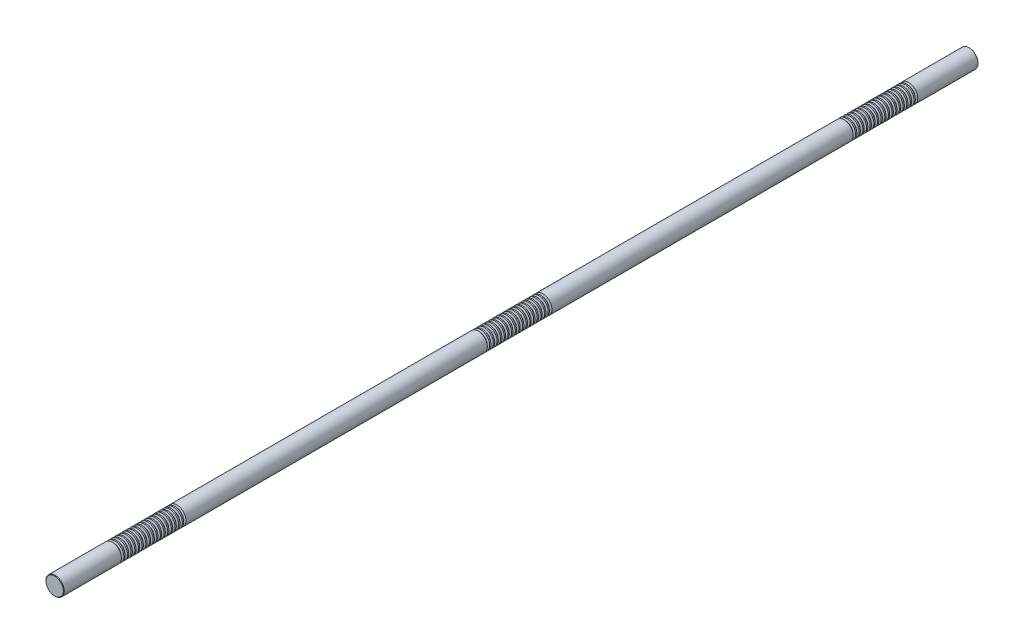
from build123d import *

# Parameters (mm, degrees)
SKETCH1_R           = 15
BOSS_EXTRUDE1_DEPTH = 750
CHAMFER1_SIZE       = 0.75
LPATTERN1_COUNT     = 18
LPATTERN1_PITCH     = 6
LPATTERN2_COUNT     = 3
LPATTERN2_PITCH     = 600


with BuildPart() as part:
    # Sketch1 → Boss-Extrude1 (new, symmetric)
    with BuildSketch(Plane.XY):
        Circle(SKETCH1_R)
    extrude(amount=BOSS_EXTRUDE1_DEPTH, both=True)

    # Chamfer1
    chamfer1_edges = [part.edges().sort_by_distance(p)[0] for p in [
        (-15, 0, -750),
        (-15, 0, 750),
    ]]
    chamfer(chamfer1_edges, length=CHAMFER1_SIZE)

    # Sketch2 → Cut-Revolve1 (revolve, cut)
    with BuildSketch(Plane(origin=(0, 0, 0), x_dir=(0, 0, -1), z_dir=(1, 0, 0)), mode=Mode.PRIVATE) as cut_revolve1_sk:
        Polygon((650.468911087, 15), (646.531088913, 15), (647.468911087, 11.5), (649.531088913, 11.5), align=None)
    cut_revolve1 = revolve(cut_revolve1_sk.sketch.rotate(Axis((0, 0, 750), (0, 0, -1)), 90), axis=Axis((0, 0, 750), (0, 0, -1)), mode=Mode.SUBTRACT)

    # LPattern1: Cut-Revolve1 ×18
    with Locations(*[(0, 0, i * LPATTERN1_PITCH) for i in range(1, LPATTERN1_COUNT)]):
        add(cut_revolve1, mode=Mode.SUBTRACT)

    # LPattern2: Cut-Revolve1 ×3
    with Locations(*[(0, 0, i * LPATTERN2_PITCH) for i in range(1, LPATTERN2_COUNT)]):
        add(cut_revolve1, mode=Mode.SUBTRACT)

    # LPattern2 copy 1 sketch → LPattern2 copy 1 (revolve, cut)
    with BuildSketch(Plane(origin=(0, 0, 606), x_dir=(0, 0, -1), z_dir=(1, 0, 0))):
        Polygon((650.468911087, 15), (646.531088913, 15), (647.468911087, 11.5), (649.531088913, 11.5), align=None)
    revolve(axis=Axis((0, 0, 1356), (0, 0, -1)), mode=Mode.SUBTRACT)

    # LPattern2 copy 2 sketch → LPattern2 copy 2 (revolve, cut)
    with BuildSketch(Plane(origin=(0, 0, 1206), x_dir=(0, 0, -1), z_dir=(1, 0, 0))):
        Polygon((650.468911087, 15), (646.531088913, 15), (647.468911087, 11.5), (649.531088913, 11.5), align=None)
    revolve(axis=Axis((0, 0, 1956), (0, 0, -1)), mode=Mode.SUBTRACT)

    # LPattern2 copy 3 sketch → LPattern2 copy 3 (revolve, cut)
    with BuildSketch(Plane(origin=(0, 0, 612), x_dir=(0, 0, -1), z_dir=(1, 0, 0))):
        Polygon((650.468911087, 15), (646.531088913, 15), (647.468911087, 11.5), (649.531088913, 11.5), align=None)
    revolve(axis=Axis((0, 0, 1362), (0, 0, -1)), mode=Mode.SUBTRACT)

    # LPattern2 copy 4 sketch → LPattern2 copy 4 (revolve, cut)
    with BuildSketch(Plane(origin=(0, 0, 1212), x_dir=(0, 0, -1), z_dir=(1, 0, 0))):
        Polygon((650.468911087, 15), (646.531088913, 15), (647.468911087, 11.5), (649.531088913, 11.5), align=None)
    revolve(axis=Axis((0, 0, 1962), (0, 0, -1)), mode=Mode.SUBTRACT)

    # LPattern2 copy 5 sketch → LPattern2 copy 5 (revolve, cut)
    with BuildSketch(Plane(origin=(0, 0, 618), x_dir=(0, 0, -1), z_dir=(1, 0, 0))):
        Polygon((650.468911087, 15), (646.531088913, 15), (647.468911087, 11.5), (649.531088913, 11.5), align=None)
    revolve(axis=Axis((0, 0, 1368), (0, 0, -1)), mode=Mode.SUBTRACT)

    # LPattern2 copy 6 sketch → LPattern2 copy 6 (revolve, cut)
    with BuildSketch(Plane(origin=(0, 0, 1218), x_dir=(0, 0, -1), z_dir=(1, 0, 0))):
        Polygon((650.468911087, 15), (646.531088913, 15), (647.468911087, 11.5), (649.531088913, 11.5), align=None)
    revolve(axis=Axis((0, 0, 1968), (0, 0, -1)), mode=Mode.SUBTRACT)

    # LPattern2 copy 7 sketch → LPattern2 copy 7 (revolve, cut)
    with BuildSketch(Plane(origin=(0, 0, 624), x_dir=(0, 0, -1), z_dir=(1, 0, 0))):
        Polygon((650.468911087, 15), (646.531088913, 15), (647.468911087, 11.5), (649.531088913, 11.5), align=None)
    revolve(axis=Axis((0, 0, 1374), (0, 0, -1)), mode=Mode.SUBTRACT)

    # LPattern2 copy 8 sketch → LPattern2 copy 8 (revolve, cut)
    with BuildSketch(Plane(origin=(0, 0, 1224), x_dir=(0, 0, -1), z_dir=(1, 0, 0))):
        Polygon((650.468911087, 15), (646.531088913, 15), (647.468911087, 11.5), (649.531088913, 11.5), align=None)
    revolve(axis=Axis((0, 0, 1974), (0, 0, -1)), mode=Mode.SUBTRACT)

    # LPattern2 copy 9 sketch → LPattern2 copy 9 (revolve, cut)
    with BuildSketch(Plane(origin=(0, 0, 630), x_dir=(0, 0, -1), z_dir=(1, 0, 0))):
        Polygon((650.468911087, 15), (646.531088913, 15), (647.468911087, 11.5), (649.531088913, 11.5), align=None)
    revolve(axis=Axis((0, 0, 1380), (0, 0, -1)), mode=Mode.SUBTRACT)

    # LPattern2 copy 10 sketch → LPattern2 copy 10 (revolve, cut)
    with BuildSketch(Plane(origin=(0, 0, 1230), x_dir=(0, 0, -1), z_dir=(1, 0, 0))):
        Polygon((650.468911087, 15), (646.531088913, 15), (647.468911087, 11.5), (649.531088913, 11.5), align=None)
    revolve(axis=Axis((0, 0, 1980), (0, 0, -1)), mode=Mode.SUBTRACT)

    # LPattern2 copy 11 sketch → LPattern2 copy 11 (revolve, cut)
    with BuildSketch(Plane(origin=(0, 0, 636), x_dir=(0, 0, -1), z_dir=(1, 0, 0))):
        Polygon((650.468911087, 15), (646.531088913, 15), (647.468911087, 11.5), (649.531088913, 11.5), align=None)
    revolve(axis=Axis((0, 0, 1386), (0, 0, -1)), mode=Mode.SUBTRACT)

    # LPattern2 copy 12 sketch → LPattern2 copy 12 (revolve, cut)
    with BuildSketch(Plane(origin=(0, 0, 1236), x_dir=(0, 0, -1), z_dir=(1, 0, 0))):
        Polygon((650.468911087, 15), (646.531088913, 15), (647.468911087, 11.5), (649.531088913, 11.5), align=None)
    revolve(axis=Axis((0, 0, 1986), (0, 0, -1)), mode=Mode.SUBTRACT)

    # LPattern2 copy 13 sketch → LPattern2 copy 13 (revolve, cut)
    with BuildSketch(Plane(origin=(0, 0, 642), x_dir=(0, 0, -1), z_dir=(1, 0, 0))):
        Polygon((650.468911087, 15), (646.531088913, 15), (647.468911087, 11.5), (649.531088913, 11.5), align=None)
    revolve(axis=Axis((0, 0, 1392), (0, 0, -1)), mode=Mode.SUBTRACT)

    # LPattern2 copy 14 sketch → LPattern2 copy 14 (revolve, cut)
    with BuildSketch(Plane(origin=(0, 0, 1242), x_dir=(0, 0, -1), z_dir=(1, 0, 0))):
        Polygon((650.468911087, 15), (646.531088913, 15), (647.468911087, 11.5), (649.531088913, 11.5), align=None)
    revolve(axis=Axis((0, 0, 1992), (0, 0, -1)), mode=Mode.SUBTRACT)

    # LPattern2 copy 15 sketch → LPattern2 copy 15 (revolve, cut)
    with BuildSketch(Plane(origin=(0, 0, 648), x_dir=(0, 0, -1), z_dir=(1, 0, 0))):
        Polygon((650.468911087, 15), (646.531088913, 15), (647.468911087, 11.5), (649.531088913, 11.5), align=None)
    revolve(axis=Axis((0, 0, 1398), (0, 0, -1)), mode=Mode.SUBTRACT)

    # LPattern2 copy 16 sketch → LPattern2 copy 16 (revolve, cut)
    with BuildSketch(Plane(origin=(0, 0, 1248), x_dir=(0, 0, -1), z_dir=(1, 0, 0))):
        Polygon((650.468911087, 15), (646.531088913, 15), (647.468911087, 11.5), (649.531088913, 11.5), align=None)
    revolve(axis=Axis((0, 0, 1998), (0, 0, -1)), mode=Mode.SUBTRACT)

    # LPattern2 copy 17 sketch → LPattern2 copy 17 (revolve, cut)
    with BuildSketch(Plane(origin=(0, 0, 654), x_dir=(0, 0, -1), z_dir=(1, 0, 0))):
        Polygon((650.468911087, 15), (646.531088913, 15), (647.468911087, 11.5), (649.531088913, 11.5), align=None)
    revolve(axis=Axis((0, 0, 1404), (0, 0, -1)), mode=Mode.SUBTRACT)

    # LPattern2 copy 18 sketch → LPattern2 copy 18 (revolve, cut)
    with BuildSketch(Plane(origin=(0, 0, 1254), x_dir=(0, 0, -1), z_dir=(1, 0, 0))):
        Polygon((650.468911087, 15), (646.531088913, 15), (647.468911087, 11.5), (649.531088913, 11.5), align=None)
    revolve(axis=Axis((0, 0, 2004), (0, 0, -1)), mode=Mode.SUBTRACT)

    # LPattern2 copy 19 sketch → LPattern2 copy 19 (revolve, cut)
    with BuildSketch(Plane(origin=(0, 0, 660), x_dir=(0, 0, -1), z_dir=(1, 0, 0))):
        Polygon((650.468911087, 15), (646.531088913, 15), (647.468911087, 11.5), (649.531088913, 11.5), align=None)
    revolve(axis=Axis((0, 0, 1410), (0, 0, -1)), mode=Mode.SUBTRACT)

    # LPattern2 copy 20 sketch → LPattern2 copy 20 (revolve, cut)
    with BuildSketch(Plane(origin=(0, 0, 1260), x_dir=(0, 0, -1), z_dir=(1, 0, 0))):
        Polygon((650.468911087, 15), (646.531088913, 15), (647.468911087, 11.5), (649.531088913, 11.5), align=None)
    revolve(axis=Axis((0, 0, 2010), (0, 0, -1)), mode=Mode.SUBTRACT)

    # LPattern2 copy 21 sketch → LPattern2 copy 21 (revolve, cut)
    with BuildSketch(Plane(origin=(0, 0, 666), x_dir=(0, 0, -1), z_dir=(1, 0, 0))):
        Polygon((650.468911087, 15), (646.531088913, 15), (647.468911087, 11.5), (649.531088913, 11.5), align=None)
    revolve(axis=Axis((0, 0, 1416), (0, 0, -1)), mode=Mode.SUBTRACT)

    # LPattern2 copy 22 sketch → LPattern2 copy 22 (revolve, cut)
    with BuildSketch(Plane(origin=(0, 0, 1266), x_dir=(0, 0, -1), z_dir=(1, 0, 0))):
        Polygon((650.468911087, 15), (646.531088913, 15), (647.468911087, 11.5), (649.531088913, 11.5), align=None)
    revolve(axis=Axis((0, 0, 2016), (0, 0, -1)), mode=Mode.SUBTRACT)

    # LPattern2 copy 23 sketch → LPattern2 copy 23 (revolve, cut)
    with BuildSketch(Plane(origin=(0, 0, 672), x_dir=(0, 0, -1), z_dir=(1, 0, 0))):
        Polygon((650.468911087, 15), (646.531088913, 15), (647.468911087, 11.5), (649.531088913, 11.5), align=None)
    revolve(axis=Axis((0, 0, 1422), (0, 0, -1)), mode=Mode.SUBTRACT)

    # LPattern2 copy 24 sketch → LPattern2 copy 24 (revolve, cut)
    with BuildSketch(Plane(origin=(0, 0, 1272), x_dir=(0, 0, -1), z_dir=(1, 0, 0))):
        Polygon((650.468911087, 15), (646.531088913, 15), (647.468911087, 11.5), (649.531088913, 11.5), align=None)
    revolve(axis=Axis((0, 0, 2022), (0, 0, -1)), mode=Mode.SUBTRACT)

    # LPattern2 copy 25 sketch → LPattern2 copy 25 (revolve, cut)
    with BuildSketch(Plane(origin=(0, 0, 678), x_dir=(0, 0, -1), z_dir=(1, 0, 0))):
        Polygon((650.468911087, 15), (646.531088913, 15), (647.468911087, 11.5), (649.531088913, 11.5), align=None)
    revolve(axis=Axis((0, 0, 1428), (0, 0, -1)), mode=Mode.SUBTRACT)

    # LPattern2 copy 26 sketch → LPattern2 copy 26 (revolve, cut)
    with BuildSketch(Plane(origin=(0, 0, 1278), x_dir=(0, 0, -1), z_dir=(1, 0, 0))):
        Polygon((650.468911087, 15), (646.531088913, 15), (647.468911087, 11.5), (649.531088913, 11.5), align=None)
    revolve(axis=Axis((0, 0, 2028), (0, 0, -1)), mode=Mode.SUBTRACT)

    # LPattern2 copy 27 sketch → LPattern2 copy 27 (revolve, cut)
    with BuildSketch(Plane(origin=(0, 0, 684), x_dir=(0, 0, -1), z_dir=(1, 0, 0))):
        Polygon((650.468911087, 15), (646.531088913, 15), (647.468911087, 11.5), (649.531088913, 11.5), align=None)
    revolve(axis=Axis((0, 0, 1434), (0, 0, -1)), mode=Mode.SUBTRACT)

    # LPattern2 copy 28 sketch → LPattern2 copy 28 (revolve, cut)
    with BuildSketch(Plane(origin=(0, 0, 1284), x_dir=(0, 0, -1), z_dir=(1, 0, 0))):
        Polygon((650.468911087, 15), (646.531088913, 15), (647.468911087, 11.5), (649.531088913, 11.5), align=None)
    revolve(axis=Axis((0, 0, 2034), (0, 0, -1)), mode=Mode.SUBTRACT)

    # LPattern2 copy 29 sketch → LPattern2 copy 29 (revolve, cut)
    with BuildSketch(Plane(origin=(0, 0, 690), x_dir=(0, 0, -1), z_dir=(1, 0, 0))):
        Polygon((650.468911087, 15), (646.531088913, 15), (647.468911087, 11.5), (649.531088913, 11.5), align=None)
    revolve(axis=Axis((0, 0, 1440), (0, 0, -1)), mode=Mode.SUBTRACT)

    # LPattern2 copy 30 sketch → LPattern2 copy 30 (revolve, cut)
    with BuildSketch(Plane(origin=(0, 0, 1290), x_dir=(0, 0, -1), z_dir=(1, 0, 0))):
        Polygon((650.468911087, 15), (646.531088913, 15), (647.468911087, 11.5), (649.531088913, 11.5), align=None)
    revolve(axis=Axis((0, 0, 2040), (0, 0, -1)), mode=Mode.SUBTRACT)

    # LPattern2 copy 31 sketch → LPattern2 copy 31 (revolve, cut)
    with BuildSketch(Plane(origin=(0, 0, 696), x_dir=(0, 0, -1), z_dir=(1, 0, 0))):
        Polygon((650.468911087, 15), (646.531088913, 15), (647.468911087, 11.5), (649.531088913, 11.5), align=None)
    revolve(axis=Axis((0, 0, 1446), (0, 0, -1)), mode=Mode.SUBTRACT)

    # LPattern2 copy 32 sketch → LPattern2 copy 32 (revolve, cut)
    with BuildSketch(Plane(origin=(0, 0, 1296), x_dir=(0, 0, -1), z_dir=(1, 0, 0))):
        Polygon((650.468911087, 15), (646.531088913, 15), (647.468911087, 11.5), (649.531088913, 11.5), align=None)
    revolve(axis=Axis((0, 0, 2046), (0, 0, -1)), mode=Mode.SUBTRACT)

    # LPattern2 copy 33 sketch → LPattern2 copy 33 (revolve, cut)
    with BuildSketch(Plane(origin=(0, 0, 702), x_dir=(0, 0, -1), z_dir=(1, 0, 0))):
        Polygon((650.468911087, 15), (646.531088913, 15), (647.468911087, 11.5), (649.531088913, 11.5), align=None)
    revolve(axis=Axis((0, 0, 1452), (0, 0, -1)), mode=Mode.SUBTRACT)

    # LPattern2 copy 34 sketch → LPattern2 copy 34 (revolve, cut)
    with BuildSketch(Plane(origin=(0, 0, 1302), x_dir=(0, 0, -1), z_dir=(1, 0, 0))):
        Polygon((650.468911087, 15), (646.531088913, 15), (647.468911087, 11.5), (649.531088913, 11.5), align=None)
    revolve(axis=Axis((0, 0, 2052), (0, 0, -1)), mode=Mode.SUBTRACT)


solid = part.part
